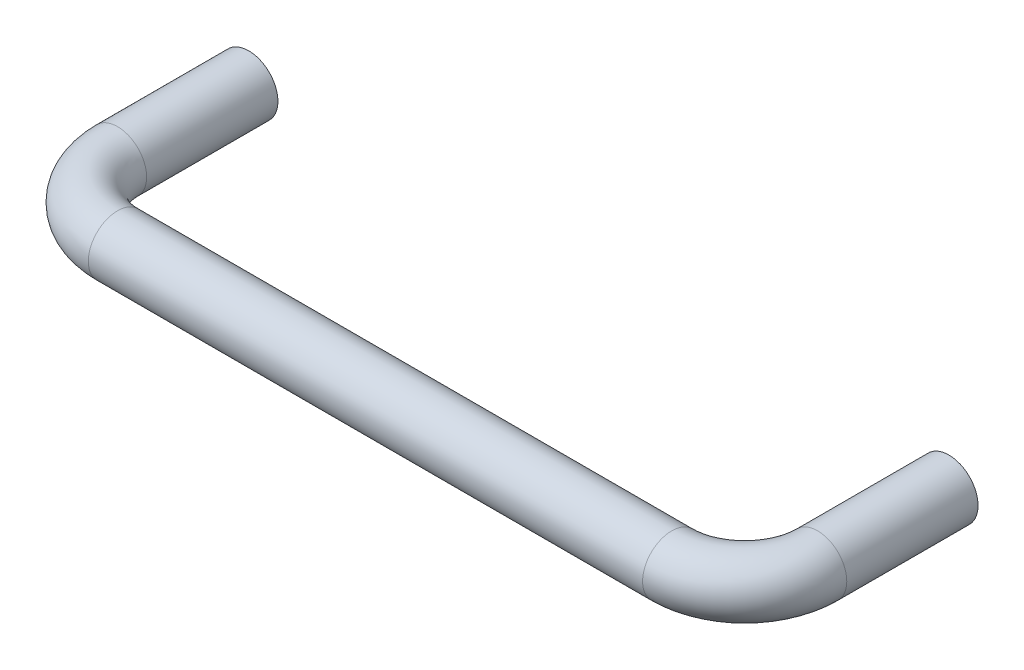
ISO-10303-21;
HEADER;
FILE_DESCRIPTION(('STEP AP214'),'2;1');
FILE_NAME('part.step','',(''),(''),'','','');
FILE_SCHEMA(('AUTOMOTIVE_DESIGN { 1 0 10303 214 1 1 1 1 }'));
ENDSEC;
DATA;
#1=APPLICATION_CONTEXT('core data for automotive mechanical design processes');
#2=APPLICATION_PROTOCOL_DEFINITION('international standard','automotive_design',2000,#1);
#3=PRODUCT_CONTEXT('',#1,'mechanical');
#4=PRODUCT('Part','Part','',(#3));
#5=PRODUCT_RELATED_PRODUCT_CATEGORY('part','',(#4));
#6=PRODUCT_DEFINITION_FORMATION('','',#4);
#7=PRODUCT_DEFINITION_CONTEXT('part definition',#1,'design');
#8=PRODUCT_DEFINITION('design','',#6,#7);
#9=PRODUCT_DEFINITION_SHAPE('','',#8);
#10=(LENGTH_UNIT() NAMED_UNIT(*) SI_UNIT(.MILLI.,.METRE.));
#11=(NAMED_UNIT(*) PLANE_ANGLE_UNIT() SI_UNIT($,.RADIAN.));
#12=(NAMED_UNIT(*) SI_UNIT($,.STERADIAN.) SOLID_ANGLE_UNIT());
#13=UNCERTAINTY_MEASURE_WITH_UNIT(LENGTH_MEASURE(1.E-05),#10,'distance_accuracy_value','');
#14=(GEOMETRIC_REPRESENTATION_CONTEXT(3) GLOBAL_UNCERTAINTY_ASSIGNED_CONTEXT((#13)) GLOBAL_UNIT_ASSIGNED_CONTEXT((#10,
#11,#12)) REPRESENTATION_CONTEXT('',''));
#15=CARTESIAN_POINT('',(0.,0.,0.));
#16=DIRECTION('',(0.,0.,1.));
#17=DIRECTION('',(1.,0.,0.));
#18=AXIS2_PLACEMENT_3D('',#15,#16,#17);
#19=CARTESIAN_POINT('',(0.,0.,22.5));
#20=DIRECTION('',(0.,0.,-1.));
#21=DIRECTION('',(0.,-1.,0.));
#22=AXIS2_PLACEMENT_3D('',#19,#20,#21);
#23=CYLINDRICAL_SURFACE('',#22,5.);
#24=CARTESIAN_POINT('',(0.,0.,0.));
#25=DIRECTION('',(0.,0.,-1.));
#26=DIRECTION('',(-1.,0.,0.));
#27=AXIS2_PLACEMENT_3D('',#24,#25,#26);
#28=CIRCLE('',#27,5.);
#29=CARTESIAN_POINT('',(-5.,0.,0.));
#30=VERTEX_POINT('',#29);
#31=EDGE_CURVE('E53',#30,#30,#28,.T.);
#32=ORIENTED_EDGE('',*,*,#31,.F.);
#33=EDGE_LOOP('',(#32));
#34=FACE_BOUND('',#33,.T.);
#35=CARTESIAN_POINT('',(0.,0.,22.5));
#36=DIRECTION('',(0.,0.,-1.));
#37=DIRECTION('',(0.,1.,0.));
#38=AXIS2_PLACEMENT_3D('',#35,#36,#37);
#39=CIRCLE('',#38,5.);
#40=CARTESIAN_POINT('',(-5.,0.,22.5));
#41=VERTEX_POINT('',#40);
#42=EDGE_CURVE('E32',#41,#41,#39,.T.);
#43=ORIENTED_EDGE('',*,*,#42,.T.);
#44=EDGE_LOOP('',(#43));
#45=FACE_BOUND('',#44,.T.);
#46=ADVANCED_FACE('F12',(#34,#45),#23,.T.);
#47=CARTESIAN_POINT('',(12.5,0.,22.5));
#48=DIRECTION('',(0.,-1.,0.));
#49=DIRECTION('',(1.,0.,0.));
#50=AXIS2_PLACEMENT_3D('',#47,#48,#49);
#51=TOROIDAL_SURFACE('',#50,12.5,5.);
#52=CARTESIAN_POINT('',(12.5,0.,35.));
#53=DIRECTION('',(-1.,0.,0.));
#54=DIRECTION('',(0.,1.,0.));
#55=AXIS2_PLACEMENT_3D('',#52,#53,#54);
#56=CIRCLE('',#55,5.);
#57=CARTESIAN_POINT('',(12.5,0.,40.));
#58=VERTEX_POINT('',#57);
#59=EDGE_CURVE('E35',#58,#58,#56,.T.);
#60=CARTESIAN_POINT('',(12.5,0.,22.5));
#61=DIRECTION('',(0.,-1.,0.));
#62=DIRECTION('',(1.,0.,0.));
#63=AXIS2_PLACEMENT_3D('',#60,#61,#62);
#64=CIRCLE('',#63,17.5);
#65=EDGE_CURVE('',#58,#41,#64,.T.);
#66=ORIENTED_EDGE('',*,*,#59,.T.);
#67=ORIENTED_EDGE('',*,*,#42,.F.);
#68=ORIENTED_EDGE('',*,*,#65,.T.);
#69=ORIENTED_EDGE('',*,*,#65,.F.);
#70=EDGE_LOOP('',(#66,#68,#67,#69));
#71=FACE_BOUND('',#70,.T.);
#72=ADVANCED_FACE('F61',(#71),#51,.T.);
#73=CARTESIAN_POINT('',(107.5,0.,35.));
#74=DIRECTION('',(-1.,0.,0.));
#75=DIRECTION('',(0.,0.,1.));
#76=AXIS2_PLACEMENT_3D('',#73,#74,#75);
#77=CYLINDRICAL_SURFACE('',#76,5.);
#78=CARTESIAN_POINT('',(107.5,0.,35.));
#79=DIRECTION('',(-1.,0.,0.));
#80=DIRECTION('',(0.,1.,0.));
#81=AXIS2_PLACEMENT_3D('',#78,#79,#80);
#82=CIRCLE('',#81,5.);
#83=CARTESIAN_POINT('',(107.5,0.,40.));
#84=VERTEX_POINT('',#83);
#85=EDGE_CURVE('E38',#84,#84,#82,.T.);
#86=ORIENTED_EDGE('',*,*,#85,.T.);
#87=EDGE_LOOP('',(#86));
#88=FACE_BOUND('',#87,.T.);
#89=ORIENTED_EDGE('',*,*,#59,.F.);
#90=EDGE_LOOP('',(#89));
#91=FACE_BOUND('',#90,.T.);
#92=ADVANCED_FACE('F66',(#88,#91),#77,.T.);
#93=CARTESIAN_POINT('',(107.5,0.,22.5));
#94=DIRECTION('',(0.,-1.,0.));
#95=DIRECTION('',(1.,0.,0.));
#96=AXIS2_PLACEMENT_3D('',#93,#94,#95);
#97=TOROIDAL_SURFACE('',#96,12.5,5.);
#98=CARTESIAN_POINT('',(120.,0.,22.5));
#99=DIRECTION('',(0.,0.,1.));
#100=DIRECTION('',(0.,1.,0.));
#101=AXIS2_PLACEMENT_3D('',#98,#99,#100);
#102=CIRCLE('',#101,5.);
#103=CARTESIAN_POINT('',(125.,0.,22.5));
#104=VERTEX_POINT('',#103);
#105=EDGE_CURVE('E41',#104,#104,#102,.T.);
#106=CARTESIAN_POINT('',(107.5,0.,22.5));
#107=DIRECTION('',(0.,-1.,0.));
#108=DIRECTION('',(1.,0.,0.));
#109=AXIS2_PLACEMENT_3D('',#106,#107,#108);
#110=CIRCLE('',#109,17.5);
#111=EDGE_CURVE('',#104,#84,#110,.T.);
#112=ORIENTED_EDGE('',*,*,#105,.T.);
#113=ORIENTED_EDGE('',*,*,#85,.F.);
#114=ORIENTED_EDGE('',*,*,#111,.T.);
#115=ORIENTED_EDGE('',*,*,#111,.F.);
#116=EDGE_LOOP('',(#112,#114,#113,#115));
#117=FACE_BOUND('',#116,.T.);
#118=ADVANCED_FACE('F74',(#117),#97,.T.);
#119=CARTESIAN_POINT('',(120.,0.,22.5));
#120=DIRECTION('',(0.,0.,-1.));
#121=DIRECTION('',(-1.,0.,0.));
#122=AXIS2_PLACEMENT_3D('',#119,#120,#121);
#123=CYLINDRICAL_SURFACE('',#122,5.);
#124=CARTESIAN_POINT('',(120.,0.,0.));
#125=DIRECTION('',(0.,0.,-1.));
#126=DIRECTION('',(-1.,0.,0.));
#127=AXIS2_PLACEMENT_3D('',#124,#125,#126);
#128=CIRCLE('',#127,5.);
#129=CARTESIAN_POINT('',(115.,0.,0.));
#130=VERTEX_POINT('',#129);
#131=EDGE_CURVE('E50',#130,#130,#128,.T.);
#132=ORIENTED_EDGE('',*,*,#131,.F.);
#133=EDGE_LOOP('',(#132));
#134=FACE_BOUND('',#133,.T.);
#135=ORIENTED_EDGE('',*,*,#105,.F.);
#136=EDGE_LOOP('',(#135));
#137=FACE_BOUND('',#136,.T.);
#138=ADVANCED_FACE('F114',(#134,#137),#123,.T.);
#139=CARTESIAN_POINT('',(122.5,0.,10.));
#140=DIRECTION('',(0.,0.,-1.));
#141=DIRECTION('',(-1.,0.,0.));
#142=AXIS2_PLACEMENT_3D('',#139,#140,#141);
#143=PLANE('',#142);
#144=CARTESIAN_POINT('',(120.,0.,10.));
#145=DIRECTION('',(0.,0.,1.));
#146=DIRECTION('',(1.,0.,0.));
#147=AXIS2_PLACEMENT_3D('',#144,#145,#146);
#148=CIRCLE('',#147,2.5);
#149=CARTESIAN_POINT('',(122.5,0.,10.));
#150=VERTEX_POINT('',#149);
#151=EDGE_CURVE('E44',#150,#150,#148,.T.);
#152=ORIENTED_EDGE('',*,*,#151,.F.);
#153=EDGE_LOOP('',(#152));
#154=FACE_BOUND('',#153,.T.);
#155=ADVANCED_FACE('F111',(#154),#143,.T.);
#156=CARTESIAN_POINT('',(120.,0.,13.6933830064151));
#157=DIRECTION('',(0.,0.,1.));
#158=DIRECTION('',(1.,0.,0.));
#159=AXIS2_PLACEMENT_3D('',#156,#157,#158);
#160=CYLINDRICAL_SURFACE('',#159,2.5);
#161=CARTESIAN_POINT('',(120.,0.,0.45));
#162=DIRECTION('',(0.,0.,-1.));
#163=DIRECTION('',(-1.,0.,0.));
#164=AXIS2_PLACEMENT_3D('',#161,#162,#163);
#165=CIRCLE('',#164,2.5);
#166=CARTESIAN_POINT('',(117.5,0.,0.45));
#167=VERTEX_POINT('',#166);
#168=EDGE_CURVE('E19',#167,#167,#165,.T.);
#169=ORIENTED_EDGE('',*,*,#168,.T.);
#170=EDGE_LOOP('',(#169));
#171=FACE_BOUND('',#170,.T.);
#172=ORIENTED_EDGE('',*,*,#151,.T.);
#173=EDGE_LOOP('',(#172));
#174=FACE_BOUND('',#173,.T.);
#175=ADVANCED_FACE('F107',(#171,#174),#160,.F.);
#176=CARTESIAN_POINT('',(135.018619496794,-11.3133185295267,0.));
#177=DIRECTION('',(0.,0.,-1.));
#178=DIRECTION('',(-1.,0.,0.));
#179=AXIS2_PLACEMENT_3D('',#176,#177,#178);
#180=PLANE('',#179);
#181=CARTESIAN_POINT('',(120.,0.,0.));
#182=DIRECTION('',(0.,0.,-1.));
#183=DIRECTION('',(-1.,0.,0.));
#184=AXIS2_PLACEMENT_3D('',#181,#182,#183);
#185=CIRCLE('',#184,2.95);
#186=CARTESIAN_POINT('',(117.05,0.,0.));
#187=VERTEX_POINT('',#186);
#188=EDGE_CURVE('E8',#187,#187,#185,.F.);
#189=ORIENTED_EDGE('',*,*,#188,.T.);
#190=EDGE_LOOP('',(#189));
#191=FACE_BOUND('',#190,.T.);
#192=ORIENTED_EDGE('',*,*,#131,.T.);
#193=EDGE_LOOP('',(#192));
#194=FACE_BOUND('',#193,.T.);
#195=ADVANCED_FACE('F90',(#191,#194),#180,.T.);
#196=CARTESIAN_POINT('',(-2.5,0.,10.));
#197=DIRECTION('',(0.,0.,-1.));
#198=DIRECTION('',(1.,0.,0.));
#199=AXIS2_PLACEMENT_3D('',#196,#197,#198);
#200=PLANE('',#199);
#201=CARTESIAN_POINT('',(0.,0.,10.));
#202=DIRECTION('',(0.,0.,-1.));
#203=DIRECTION('',(-1.,0.,0.));
#204=AXIS2_PLACEMENT_3D('',#201,#202,#203);
#205=CIRCLE('',#204,2.5);
#206=CARTESIAN_POINT('',(-2.5,0.,10.));
#207=VERTEX_POINT('',#206);
#208=EDGE_CURVE('E47',#207,#207,#205,.T.);
#209=ORIENTED_EDGE('',*,*,#208,.T.);
#210=EDGE_LOOP('',(#209));
#211=FACE_BOUND('',#210,.T.);
#212=ADVANCED_FACE('F97',(#211),#200,.T.);
#213=CARTESIAN_POINT('',(0.,0.,13.6933830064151));
#214=DIRECTION('',(0.,0.,1.));
#215=DIRECTION('',(-1.,0.,0.));
#216=AXIS2_PLACEMENT_3D('',#213,#214,#215);
#217=CYLINDRICAL_SURFACE('',#216,2.5);
#218=CARTESIAN_POINT('',(0.,0.,0.45));
#219=DIRECTION('',(0.,0.,-1.));
#220=DIRECTION('',(-1.,0.,0.));
#221=AXIS2_PLACEMENT_3D('',#218,#219,#220);
#222=CIRCLE('',#221,2.5);
#223=CARTESIAN_POINT('',(-2.5,0.,0.450000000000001));
#224=VERTEX_POINT('',#223);
#225=EDGE_CURVE('E27',#224,#224,#222,.T.);
#226=ORIENTED_EDGE('',*,*,#225,.T.);
#227=EDGE_LOOP('',(#226));
#228=FACE_BOUND('',#227,.T.);
#229=ORIENTED_EDGE('',*,*,#208,.F.);
#230=EDGE_LOOP('',(#229));
#231=FACE_BOUND('',#230,.T.);
#232=ADVANCED_FACE('F87',(#228,#231),#217,.F.);
#233=CARTESIAN_POINT('',(0.,0.,0.));
#234=DIRECTION('',(0.,0.,-1.));
#235=DIRECTION('',(-1.,0.,0.));
#236=AXIS2_PLACEMENT_3D('',#233,#234,#235);
#237=CIRCLE('',#236,2.95);
#238=CARTESIAN_POINT('',(-2.95,0.,0.));
#239=VERTEX_POINT('',#238);
#240=EDGE_CURVE('E23',#239,#239,#237,.F.);
#241=ORIENTED_EDGE('',*,*,#240,.T.);
#242=EDGE_LOOP('',(#241));
#243=FACE_BOUND('',#242,.T.);
#244=ORIENTED_EDGE('',*,*,#31,.T.);
#245=EDGE_LOOP('',(#244));
#246=FACE_BOUND('',#245,.T.);
#247=ADVANCED_FACE('F57',(#243,#246),#180,.T.);
#248=CARTESIAN_POINT('',(0.,0.,0.45));
#249=DIRECTION('',(0.,0.,-1.));
#250=DIRECTION('',(-1.,0.,0.));
#251=AXIS2_PLACEMENT_3D('',#248,#249,#250);
#252=CONICAL_SURFACE('',#251,2.5,0.785398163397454);
#253=ORIENTED_EDGE('',*,*,#240,.F.);
#254=EDGE_LOOP('',(#253));
#255=FACE_BOUND('',#254,.T.);
#256=ORIENTED_EDGE('',*,*,#225,.F.);
#257=EDGE_LOOP('',(#256));
#258=FACE_BOUND('',#257,.T.);
#259=ADVANCED_FACE('F78',(#255,#258),#252,.F.);
#260=CARTESIAN_POINT('',(120.,0.,0.45));
#261=DIRECTION('',(0.,0.,-1.));
#262=DIRECTION('',(-1.,0.,0.));
#263=AXIS2_PLACEMENT_3D('',#260,#261,#262);
#264=CONICAL_SURFACE('',#263,2.5,0.785398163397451);
#265=ORIENTED_EDGE('',*,*,#188,.F.);
#266=EDGE_LOOP('',(#265));
#267=FACE_BOUND('',#266,.T.);
#268=ORIENTED_EDGE('',*,*,#168,.F.);
#269=EDGE_LOOP('',(#268));
#270=FACE_BOUND('',#269,.T.);
#271=ADVANCED_FACE('F14',(#267,#270),#264,.F.);
#272=CLOSED_SHELL('',(#46,#72,#92,#118,#138,#155,#175,#195,#212,#232,#247,#259,#271));
#273=MANIFOLD_SOLID_BREP('B1',#272);
#274=ADVANCED_BREP_SHAPE_REPRESENTATION('',(#18,#273),#14);
#275=SHAPE_DEFINITION_REPRESENTATION(#9,#274);
ENDSEC;
END-ISO-10303-21;
